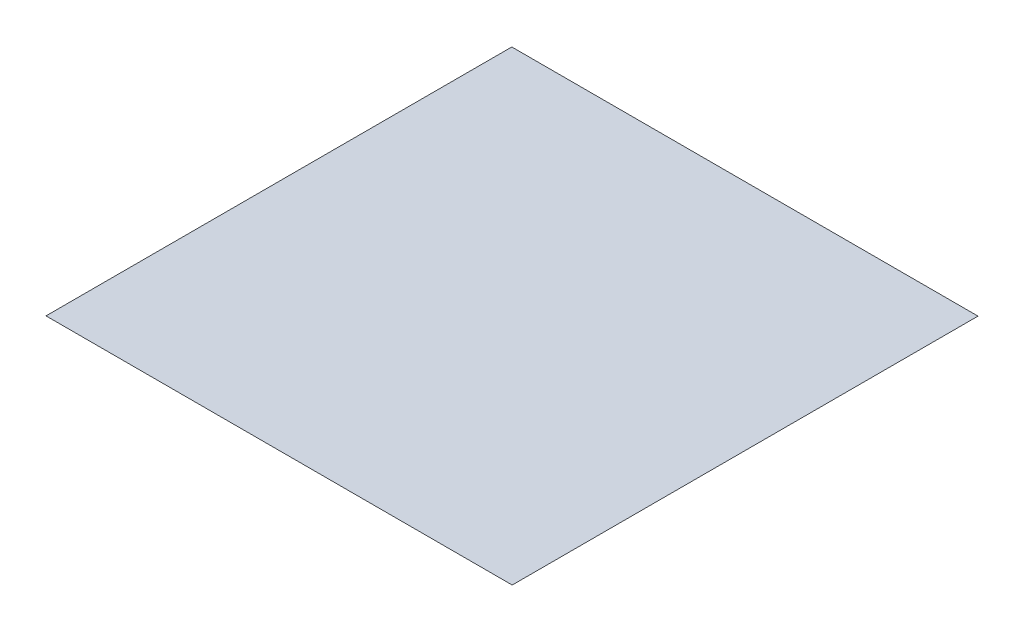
ISO-10303-21;
HEADER;
FILE_DESCRIPTION(('STEP AP214'),'2;1');
FILE_NAME('part.step','',(''),(''),'','','');
FILE_SCHEMA(('AUTOMOTIVE_DESIGN { 1 0 10303 214 1 1 1 1 }'));
ENDSEC;
DATA;
#1=APPLICATION_CONTEXT('core data for automotive mechanical design processes');
#2=APPLICATION_PROTOCOL_DEFINITION('international standard','automotive_design',2000,#1);
#3=PRODUCT_CONTEXT('',#1,'mechanical');
#4=PRODUCT('Part','Part','',(#3));
#5=PRODUCT_RELATED_PRODUCT_CATEGORY('part','',(#4));
#6=PRODUCT_DEFINITION_FORMATION('','',#4);
#7=PRODUCT_DEFINITION_CONTEXT('part definition',#1,'design');
#8=PRODUCT_DEFINITION('design','',#6,#7);
#9=PRODUCT_DEFINITION_SHAPE('','',#8);
#10=(LENGTH_UNIT() NAMED_UNIT(*) SI_UNIT(.MILLI.,.METRE.));
#11=(NAMED_UNIT(*) PLANE_ANGLE_UNIT() SI_UNIT($,.RADIAN.));
#12=(NAMED_UNIT(*) SI_UNIT($,.STERADIAN.) SOLID_ANGLE_UNIT());
#13=UNCERTAINTY_MEASURE_WITH_UNIT(LENGTH_MEASURE(1.E-05),#10,'distance_accuracy_value','');
#14=(GEOMETRIC_REPRESENTATION_CONTEXT(3) GLOBAL_UNCERTAINTY_ASSIGNED_CONTEXT((#13)) GLOBAL_UNIT_ASSIGNED_CONTEXT((#10,
#11,#12)) REPRESENTATION_CONTEXT('',''));
#15=CARTESIAN_POINT('',(0.,0.,0.));
#16=DIRECTION('',(0.,0.,1.));
#17=DIRECTION('',(1.,0.,0.));
#18=AXIS2_PLACEMENT_3D('',#15,#16,#17);
#19=CARTESIAN_POINT('',(0.,0.,0.));
#20=DIRECTION('',(-0.707106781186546,0.707106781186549,0.));
#21=DIRECTION('',(-0.707106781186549,-0.707106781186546,0.));
#22=AXIS2_PLACEMENT_3D('',#19,#20,#21);
#23=PLANE('',#22);
#24=DIRECTION('',(0.575798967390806,0.575798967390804,0.580440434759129));
#25=VECTOR('',#24,1.);
#26=CARTESIAN_POINT('',(1.06379877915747,1.06379877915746,-2.11058431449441));
#27=LINE('',#26,#25);
#28=CARTESIAN_POINT('',(3.1575058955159,3.15750589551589,4.43603386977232E-13));
#29=VERTEX_POINT('',#28);
#30=CARTESIAN_POINT('',(355.600000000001,355.6,355.283503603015));
#31=VERTEX_POINT('',#30);
#32=EDGE_CURVE('E49',#29,#31,#27,.T.);
#33=ORIENTED_EDGE('',*,*,#32,.F.);
#34=DIRECTION('',(-0.575798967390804,-0.575798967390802,0.580440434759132));
#35=VECTOR('',#34,1.);
#36=CARTESIAN_POINT('',(1.06379877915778,1.06379877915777,2.11058431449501));
#37=LINE('',#36,#35);
#38=CARTESIAN_POINT('',(355.600000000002,355.600000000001,-355.283503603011));
#39=VERTEX_POINT('',#38);
#40=EDGE_CURVE('E12',#39,#29,#37,.T.);
#41=ORIENTED_EDGE('',*,*,#40,.F.);
#42=DIRECTION('',(0.,0.,1.));
#43=VECTOR('',#42,1.);
#44=CARTESIAN_POINT('',(355.600000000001,355.6,509.735462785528));
#45=LINE('',#44,#43);
#46=EDGE_CURVE('E66',#39,#31,#45,.T.);
#47=ORIENTED_EDGE('',*,*,#46,.T.);
#48=EDGE_LOOP('',(#33,#41,#47));
#49=FACE_BOUND('',#48,.T.);
#50=ADVANCED_FACE('F34',(#49),#23,.F.);
#51=CARTESIAN_POINT('',(0.,1.59142785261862,-1.57870206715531));
#52=DIRECTION('',(0.,0.709939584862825,-0.704262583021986));
#53=DIRECTION('',(0.,0.704262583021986,0.709939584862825));
#54=AXIS2_PLACEMENT_3D('',#51,#52,#53);
#55=PLANE('',#54);
#56=DIRECTION('',(-1.,0.,0.));
#57=VECTOR('',#56,1.);
#58=CARTESIAN_POINT('',(0.,3.15750589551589,4.59254593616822E-13));
#59=LINE('',#58,#57);
#60=CARTESIAN_POINT('',(-3.1575058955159,3.15750589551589,4.75045243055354E-13));
#61=VERTEX_POINT('',#60);
#62=EDGE_CURVE('E42',#29,#61,#59,.T.);
#63=ORIENTED_EDGE('',*,*,#62,.F.);
#64=ORIENTED_EDGE('',*,*,#32,.T.);
#65=DIRECTION('',(-1.,0.,0.));
#66=VECTOR('',#65,1.);
#67=CARTESIAN_POINT('',(-553.177534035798,355.6,355.283503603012));
#68=LINE('',#67,#66);
#69=CARTESIAN_POINT('',(-355.600000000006,355.600000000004,355.283503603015));
#70=VERTEX_POINT('',#69);
#71=EDGE_CURVE('E73',#31,#70,#68,.T.);
#72=ORIENTED_EDGE('',*,*,#71,.T.);
#73=DIRECTION('',(-0.575798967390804,0.575798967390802,0.580440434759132));
#74=VECTOR('',#73,1.);
#75=CARTESIAN_POINT('',(-1.06379877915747,1.06379877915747,-2.1105843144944));
#76=LINE('',#75,#74);
#77=EDGE_CURVE('E84',#61,#70,#76,.T.);
#78=ORIENTED_EDGE('',*,*,#77,.F.);
#79=EDGE_LOOP('',(#63,#64,#72,#78));
#80=FACE_BOUND('',#79,.T.);
#81=ADVANCED_FACE('F88',(#80),#55,.F.);
#82=CARTESIAN_POINT('',(0.,0.,0.));
#83=DIRECTION('',(0.707106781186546,0.707106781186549,0.));
#84=DIRECTION('',(-0.707106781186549,0.707106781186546,0.));
#85=AXIS2_PLACEMENT_3D('',#82,#83,#84);
#86=PLANE('',#85);
#87=DIRECTION('',(-0.575798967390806,0.575798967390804,-0.580440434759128));
#88=VECTOR('',#87,1.);
#89=CARTESIAN_POINT('',(-1.06379877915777,1.06379877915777,2.11058431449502));
#90=LINE('',#89,#88);
#91=CARTESIAN_POINT('',(-355.600000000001,355.6,-355.283503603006));
#92=VERTEX_POINT('',#91);
#93=EDGE_CURVE('E77',#61,#92,#90,.T.);
#94=ORIENTED_EDGE('',*,*,#93,.F.);
#95=ORIENTED_EDGE('',*,*,#77,.T.);
#96=DIRECTION('',(0.,0.,-1.));
#97=VECTOR('',#96,1.);
#98=CARTESIAN_POINT('',(-355.600000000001,355.6,509.735462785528));
#99=LINE('',#98,#97);
#100=EDGE_CURVE('E78',#70,#92,#99,.T.);
#101=ORIENTED_EDGE('',*,*,#100,.T.);
#102=EDGE_LOOP('',(#94,#95,#101));
#103=FACE_BOUND('',#102,.T.);
#104=ADVANCED_FACE('F90',(#103),#86,.F.);
#105=CARTESIAN_POINT('',(-553.177534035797,355.6,509.735462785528));
#106=DIRECTION('',(0.,1.,0.));
#107=DIRECTION('',(0.,0.,1.));
#108=AXIS2_PLACEMENT_3D('',#105,#106,#107);
#109=PLANE('',#108);
#110=ORIENTED_EDGE('',*,*,#46,.F.);
#111=DIRECTION('',(1.,0.,0.));
#112=VECTOR('',#111,1.);
#113=CARTESIAN_POINT('',(-553.177534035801,355.6,-355.283503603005));
#114=LINE('',#113,#112);
#115=EDGE_CURVE('E72',#92,#39,#114,.T.);
#116=ORIENTED_EDGE('',*,*,#115,.F.);
#117=ORIENTED_EDGE('',*,*,#100,.F.);
#118=ORIENTED_EDGE('',*,*,#71,.F.);
#119=EDGE_LOOP('',(#110,#116,#117,#118));
#120=FACE_BOUND('',#119,.T.);
#121=ADVANCED_FACE('F36',(#120),#109,.T.);
#122=CARTESIAN_POINT('',(0.,1.59142785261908,1.57870206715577));
#123=DIRECTION('',(0.,0.709939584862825,0.704262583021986));
#124=DIRECTION('',(0.,-0.704262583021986,0.709939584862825));
#125=AXIS2_PLACEMENT_3D('',#122,#123,#124);
#126=PLANE('',#125);
#127=ORIENTED_EDGE('',*,*,#115,.T.);
#128=ORIENTED_EDGE('',*,*,#40,.T.);
#129=ORIENTED_EDGE('',*,*,#62,.T.);
#130=ORIENTED_EDGE('',*,*,#93,.T.);
#131=EDGE_LOOP('',(#127,#128,#129,#130));
#132=FACE_BOUND('',#131,.T.);
#133=ADVANCED_FACE('F75',(#132),#126,.F.);
#134=CLOSED_SHELL('',(#50,#81,#104,#121,#133));
#135=MANIFOLD_SOLID_BREP('B2',#134);
#136=ADVANCED_BREP_SHAPE_REPRESENTATION('',(#18,#135),#14);
#137=SHAPE_DEFINITION_REPRESENTATION(#9,#136);
ENDSEC;
END-ISO-10303-21;
